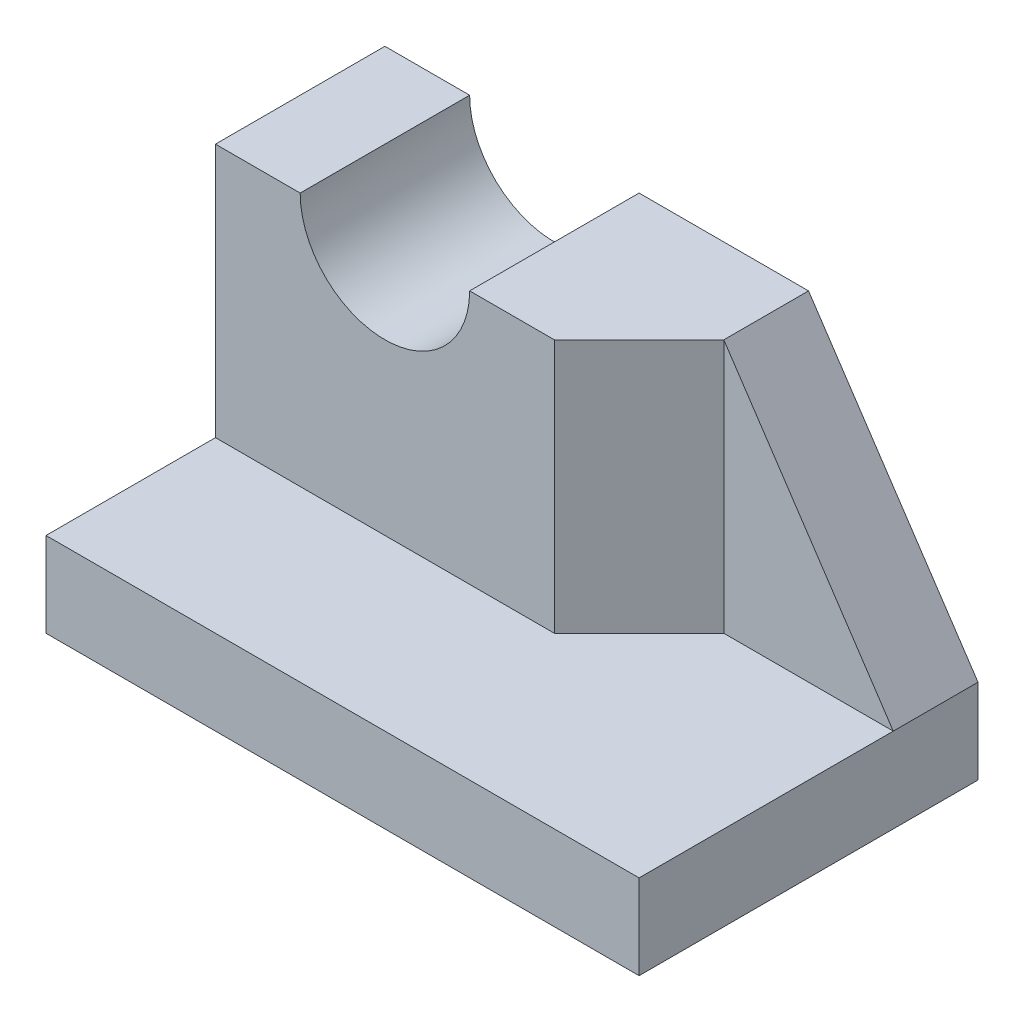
ISO-10303-21;
HEADER;
FILE_DESCRIPTION(('STEP AP214'),'2;1');
FILE_NAME('part.step','',(''),(''),'','','');
FILE_SCHEMA(('AUTOMOTIVE_DESIGN { 1 0 10303 214 1 1 1 1 }'));
ENDSEC;
DATA;
#1=APPLICATION_CONTEXT('core data for automotive mechanical design processes');
#2=APPLICATION_PROTOCOL_DEFINITION('international standard','automotive_design',2000,#1);
#3=PRODUCT_CONTEXT('',#1,'mechanical');
#4=PRODUCT('Part','Part','',(#3));
#5=PRODUCT_RELATED_PRODUCT_CATEGORY('part','',(#4));
#6=PRODUCT_DEFINITION_FORMATION('','',#4);
#7=PRODUCT_DEFINITION_CONTEXT('part definition',#1,'design');
#8=PRODUCT_DEFINITION('design','',#6,#7);
#9=PRODUCT_DEFINITION_SHAPE('','',#8);
#10=(LENGTH_UNIT() NAMED_UNIT(*) SI_UNIT(.MILLI.,.METRE.));
#11=(NAMED_UNIT(*) PLANE_ANGLE_UNIT() SI_UNIT($,.RADIAN.));
#12=(NAMED_UNIT(*) SI_UNIT($,.STERADIAN.) SOLID_ANGLE_UNIT());
#13=UNCERTAINTY_MEASURE_WITH_UNIT(LENGTH_MEASURE(1.E-05),#10,'distance_accuracy_value','');
#14=(GEOMETRIC_REPRESENTATION_CONTEXT(3) GLOBAL_UNCERTAINTY_ASSIGNED_CONTEXT((#13)) GLOBAL_UNIT_ASSIGNED_CONTEXT((#10,
#11,#12)) REPRESENTATION_CONTEXT('',''));
#15=CARTESIAN_POINT('',(0.,0.,0.));
#16=DIRECTION('',(0.,0.,1.));
#17=DIRECTION('',(1.,0.,0.));
#18=AXIS2_PLACEMENT_3D('',#15,#16,#17);
#19=CARTESIAN_POINT('',(-35.,10.,-20.));
#20=DIRECTION('',(0.,-1.,0.));
#21=DIRECTION('',(0.,0.,-1.));
#22=AXIS2_PLACEMENT_3D('',#19,#20,#21);
#23=PLANE('',#22);
#24=DIRECTION('',(1.,0.,0.));
#25=VECTOR('',#24,1.);
#26=CARTESIAN_POINT('',(-35.,10.,-9.99999999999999));
#27=LINE('',#26,#25);
#28=CARTESIAN_POINT('',(15.,10.,-9.99999999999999));
#29=VERTEX_POINT('',#28);
#30=CARTESIAN_POINT('',(35.,10.,-9.99999999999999));
#31=VERTEX_POINT('',#30);
#32=EDGE_CURVE('E125',#29,#31,#27,.T.);
#33=ORIENTED_EDGE('',*,*,#32,.F.);
#34=DIRECTION('',(0.707106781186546,0.,-0.707106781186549));
#35=VECTOR('',#34,1.);
#36=CARTESIAN_POINT('',(4.99999999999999,10.,0.));
#37=LINE('',#36,#35);
#38=CARTESIAN_POINT('',(4.99999999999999,10.,0.));
#39=VERTEX_POINT('',#38);
#40=EDGE_CURVE('E138',#39,#29,#37,.T.);
#41=ORIENTED_EDGE('',*,*,#40,.F.);
#42=DIRECTION('',(1.,0.,0.));
#43=VECTOR('',#42,1.);
#44=CARTESIAN_POINT('',(-35.,10.,0.));
#45=LINE('',#44,#43);
#46=CARTESIAN_POINT('',(-35.,10.,0.));
#47=VERTEX_POINT('',#46);
#48=EDGE_CURVE('E52',#47,#39,#45,.T.);
#49=ORIENTED_EDGE('',*,*,#48,.F.);
#50=DIRECTION('',(0.,0.,1.));
#51=VECTOR('',#50,1.);
#52=CARTESIAN_POINT('',(-35.,10.,20.));
#53=LINE('',#52,#51);
#54=CARTESIAN_POINT('',(-35.,10.,20.));
#55=VERTEX_POINT('',#54);
#56=EDGE_CURVE('E152',#47,#55,#53,.T.);
#57=ORIENTED_EDGE('',*,*,#56,.T.);
#58=DIRECTION('',(1.,0.,0.));
#59=VECTOR('',#58,1.);
#60=CARTESIAN_POINT('',(-35.,10.,20.));
#61=LINE('',#60,#59);
#62=CARTESIAN_POINT('',(35.,10.,20.));
#63=VERTEX_POINT('',#62);
#64=EDGE_CURVE('E149',#55,#63,#61,.T.);
#65=ORIENTED_EDGE('',*,*,#64,.T.);
#66=DIRECTION('',(0.,0.,-1.));
#67=VECTOR('',#66,1.);
#68=CARTESIAN_POINT('',(35.,10.,20.));
#69=LINE('',#68,#67);
#70=EDGE_CURVE('E184',#63,#31,#69,.T.);
#71=ORIENTED_EDGE('',*,*,#70,.T.);
#72=EDGE_LOOP('',(#33,#41,#49,#57,#65,#71));
#73=FACE_BOUND('',#72,.T.);
#74=ADVANCED_FACE('F30',(#73),#23,.F.);
#75=CARTESIAN_POINT('',(-35.,40.,0.));
#76=DIRECTION('',(0.,1.,0.));
#77=DIRECTION('',(0.,0.,1.));
#78=AXIS2_PLACEMENT_3D('',#75,#76,#77);
#79=PLANE('',#78);
#80=DIRECTION('',(0.,0.,1.));
#81=VECTOR('',#80,1.);
#82=CARTESIAN_POINT('',(-35.,40.,-20.));
#83=LINE('',#82,#81);
#84=CARTESIAN_POINT('',(-35.,40.,-20.));
#85=VERTEX_POINT('',#84);
#86=CARTESIAN_POINT('',(-35.,40.,0.));
#87=VERTEX_POINT('',#86);
#88=EDGE_CURVE('E201',#85,#87,#83,.T.);
#89=ORIENTED_EDGE('',*,*,#88,.T.);
#90=DIRECTION('',(1.,0.,0.));
#91=VECTOR('',#90,1.);
#92=CARTESIAN_POINT('',(-35.,40.,0.));
#93=LINE('',#92,#91);
#94=CARTESIAN_POINT('',(-25.,40.,0.));
#95=VERTEX_POINT('',#94);
#96=EDGE_CURVE('E134',#87,#95,#93,.T.);
#97=ORIENTED_EDGE('',*,*,#96,.T.);
#98=DIRECTION('',(0.,0.,1.));
#99=VECTOR('',#98,1.);
#100=CARTESIAN_POINT('',(-25.,40.,-30.));
#101=LINE('',#100,#99);
#102=CARTESIAN_POINT('',(-25.,40.,-20.));
#103=VERTEX_POINT('',#102);
#104=EDGE_CURVE('E11',#103,#95,#101,.T.);
#105=ORIENTED_EDGE('',*,*,#104,.F.);
#106=DIRECTION('',(-1.,0.,0.));
#107=VECTOR('',#106,1.);
#108=CARTESIAN_POINT('',(15.,40.,-20.));
#109=LINE('',#108,#107);
#110=EDGE_CURVE('E117',#103,#85,#109,.T.);
#111=ORIENTED_EDGE('',*,*,#110,.T.);
#112=EDGE_LOOP('',(#89,#97,#105,#111));
#113=FACE_BOUND('',#112,.T.);
#114=ADVANCED_FACE('F207',(#113),#79,.T.);
#115=CARTESIAN_POINT('',(-35.,10.,20.));
#116=DIRECTION('',(1.,0.,0.));
#117=DIRECTION('',(0.,0.,-1.));
#118=AXIS2_PLACEMENT_3D('',#115,#116,#117);
#119=PLANE('',#118);
#120=DIRECTION('',(0.,0.,1.));
#121=VECTOR('',#120,1.);
#122=CARTESIAN_POINT('',(-35.,0.,20.));
#123=LINE('',#122,#121);
#124=CARTESIAN_POINT('',(-35.,0.,-20.));
#125=VERTEX_POINT('',#124);
#126=CARTESIAN_POINT('',(-35.,0.,20.));
#127=VERTEX_POINT('',#126);
#128=EDGE_CURVE('E164',#125,#127,#123,.T.);
#129=ORIENTED_EDGE('',*,*,#128,.T.);
#130=DIRECTION('',(0.,-1.,0.));
#131=VECTOR('',#130,1.);
#132=CARTESIAN_POINT('',(-35.,10.,20.));
#133=LINE('',#132,#131);
#134=EDGE_CURVE('E156',#55,#127,#133,.T.);
#135=ORIENTED_EDGE('',*,*,#134,.F.);
#136=ORIENTED_EDGE('',*,*,#56,.F.);
#137=DIRECTION('',(0.,-1.,0.));
#138=VECTOR('',#137,1.);
#139=CARTESIAN_POINT('',(-35.,40.,0.));
#140=LINE('',#139,#138);
#141=EDGE_CURVE('E142',#87,#47,#140,.T.);
#142=ORIENTED_EDGE('',*,*,#141,.F.);
#143=ORIENTED_EDGE('',*,*,#88,.F.);
#144=DIRECTION('',(0.,-1.,0.));
#145=VECTOR('',#144,1.);
#146=CARTESIAN_POINT('',(-35.,10.,-20.));
#147=LINE('',#146,#145);
#148=EDGE_CURVE('E179',#85,#125,#147,.T.);
#149=ORIENTED_EDGE('',*,*,#148,.T.);
#150=EDGE_LOOP('',(#129,#135,#136,#142,#143,#149));
#151=FACE_BOUND('',#150,.T.);
#152=ADVANCED_FACE('F32',(#151),#119,.F.);
#153=CARTESIAN_POINT('',(-35.,10.,20.));
#154=DIRECTION('',(0.,0.,-1.));
#155=DIRECTION('',(-1.,0.,0.));
#156=AXIS2_PLACEMENT_3D('',#153,#154,#155);
#157=PLANE('',#156);
#158=DIRECTION('',(1.,0.,0.));
#159=VECTOR('',#158,1.);
#160=CARTESIAN_POINT('',(-35.,0.,20.));
#161=LINE('',#160,#159);
#162=CARTESIAN_POINT('',(35.,0.,20.));
#163=VERTEX_POINT('',#162);
#164=EDGE_CURVE('E188',#127,#163,#161,.T.);
#165=ORIENTED_EDGE('',*,*,#164,.T.);
#166=DIRECTION('',(0.,-1.,0.));
#167=VECTOR('',#166,1.);
#168=CARTESIAN_POINT('',(35.,10.,20.));
#169=LINE('',#168,#167);
#170=EDGE_CURVE('E168',#63,#163,#169,.T.);
#171=ORIENTED_EDGE('',*,*,#170,.F.);
#172=ORIENTED_EDGE('',*,*,#64,.F.);
#173=ORIENTED_EDGE('',*,*,#134,.T.);
#174=EDGE_LOOP('',(#165,#171,#172,#173));
#175=FACE_BOUND('',#174,.T.);
#176=ADVANCED_FACE('F191',(#175),#157,.F.);
#177=CARTESIAN_POINT('',(35.,10.,20.));
#178=DIRECTION('',(-1.,0.,0.));
#179=DIRECTION('',(0.,0.,1.));
#180=AXIS2_PLACEMENT_3D('',#177,#178,#179);
#181=PLANE('',#180);
#182=DIRECTION('',(0.,0.,-1.));
#183=VECTOR('',#182,1.);
#184=CARTESIAN_POINT('',(35.,10.,20.));
#185=LINE('',#184,#183);
#186=CARTESIAN_POINT('',(35.,9.99999999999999,-20.));
#187=VERTEX_POINT('',#186);
#188=EDGE_CURVE('E195',#31,#187,#185,.T.);
#189=ORIENTED_EDGE('',*,*,#188,.F.);
#190=ORIENTED_EDGE('',*,*,#70,.F.);
#191=ORIENTED_EDGE('',*,*,#170,.T.);
#192=DIRECTION('',(0.,0.,-1.));
#193=VECTOR('',#192,1.);
#194=CARTESIAN_POINT('',(35.,0.,20.));
#195=LINE('',#194,#193);
#196=CARTESIAN_POINT('',(35.,0.,-20.));
#197=VERTEX_POINT('',#196);
#198=EDGE_CURVE('E186',#163,#197,#195,.T.);
#199=ORIENTED_EDGE('',*,*,#198,.T.);
#200=DIRECTION('',(0.,-1.,0.));
#201=VECTOR('',#200,1.);
#202=CARTESIAN_POINT('',(35.,10.,-20.));
#203=LINE('',#202,#201);
#204=EDGE_CURVE('E173',#187,#197,#203,.T.);
#205=ORIENTED_EDGE('',*,*,#204,.F.);
#206=EDGE_LOOP('',(#189,#190,#191,#199,#205));
#207=FACE_BOUND('',#206,.T.);
#208=ADVANCED_FACE('F193',(#207),#181,.F.);
#209=CARTESIAN_POINT('',(-35.,10.,-20.));
#210=DIRECTION('',(0.,0.,1.));
#211=DIRECTION('',(1.,0.,0.));
#212=AXIS2_PLACEMENT_3D('',#209,#210,#211);
#213=PLANE('',#212);
#214=ORIENTED_EDGE('',*,*,#110,.F.);
#215=CARTESIAN_POINT('',(-15.,40.,-20.));
#216=DIRECTION('',(0.,0.,1.));
#217=DIRECTION('',(1.,0.,0.));
#218=AXIS2_PLACEMENT_3D('',#215,#216,#217);
#219=CIRCLE('',#218,10.);
#220=CARTESIAN_POINT('',(-5.00000000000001,40.,-20.));
#221=VERTEX_POINT('',#220);
#222=EDGE_CURVE('E159',#103,#221,#219,.T.);
#223=ORIENTED_EDGE('',*,*,#222,.T.);
#224=CARTESIAN_POINT('',(15.,40.,-20.));
#225=VERTEX_POINT('',#224);
#226=EDGE_CURVE('E140',#225,#221,#109,.T.);
#227=ORIENTED_EDGE('',*,*,#226,.F.);
#228=DIRECTION('',(0.554700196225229,-0.832050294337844,0.));
#229=VECTOR('',#228,1.);
#230=CARTESIAN_POINT('',(15.,40.,-20.));
#231=LINE('',#230,#229);
#232=EDGE_CURVE('E112',#225,#187,#231,.T.);
#233=ORIENTED_EDGE('',*,*,#232,.T.);
#234=ORIENTED_EDGE('',*,*,#204,.T.);
#235=DIRECTION('',(-1.,0.,0.));
#236=VECTOR('',#235,1.);
#237=CARTESIAN_POINT('',(-35.,0.,-20.));
#238=LINE('',#237,#236);
#239=EDGE_CURVE('E155',#197,#125,#238,.T.);
#240=ORIENTED_EDGE('',*,*,#239,.T.);
#241=ORIENTED_EDGE('',*,*,#148,.F.);
#242=EDGE_LOOP('',(#214,#223,#227,#233,#234,#240,#241));
#243=FACE_BOUND('',#242,.T.);
#244=ADVANCED_FACE('F220',(#243),#213,.F.);
#245=CARTESIAN_POINT('',(-35.,0.,-20.));
#246=DIRECTION('',(0.,-1.,0.));
#247=DIRECTION('',(0.,0.,-1.));
#248=AXIS2_PLACEMENT_3D('',#245,#246,#247);
#249=PLANE('',#248);
#250=ORIENTED_EDGE('',*,*,#239,.F.);
#251=ORIENTED_EDGE('',*,*,#198,.F.);
#252=ORIENTED_EDGE('',*,*,#164,.F.);
#253=ORIENTED_EDGE('',*,*,#128,.F.);
#254=EDGE_LOOP('',(#250,#251,#252,#253));
#255=FACE_BOUND('',#254,.T.);
#256=ADVANCED_FACE('F218',(#255),#249,.T.);
#257=CARTESIAN_POINT('',(-35.,40.,0.));
#258=DIRECTION('',(0.,0.,-1.));
#259=DIRECTION('',(-1.,0.,0.));
#260=AXIS2_PLACEMENT_3D('',#257,#258,#259);
#261=PLANE('',#260);
#262=CARTESIAN_POINT('',(-5.00000000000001,40.,0.));
#263=VERTEX_POINT('',#262);
#264=CARTESIAN_POINT('',(4.99999999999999,40.,0.));
#265=VERTEX_POINT('',#264);
#266=EDGE_CURVE('E130',#263,#265,#93,.T.);
#267=ORIENTED_EDGE('',*,*,#266,.F.);
#268=CARTESIAN_POINT('',(-15.,40.,0.));
#269=DIRECTION('',(0.,0.,1.));
#270=DIRECTION('',(1.,0.,0.));
#271=AXIS2_PLACEMENT_3D('',#268,#269,#270);
#272=CIRCLE('',#271,10.);
#273=EDGE_CURVE('E44',#95,#263,#272,.T.);
#274=ORIENTED_EDGE('',*,*,#273,.F.);
#275=ORIENTED_EDGE('',*,*,#96,.F.);
#276=ORIENTED_EDGE('',*,*,#141,.T.);
#277=ORIENTED_EDGE('',*,*,#48,.T.);
#278=DIRECTION('',(0.,-1.,0.));
#279=VECTOR('',#278,1.);
#280=CARTESIAN_POINT('',(4.99999999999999,40.,0.));
#281=LINE('',#280,#279);
#282=EDGE_CURVE('E139',#265,#39,#281,.T.);
#283=ORIENTED_EDGE('',*,*,#282,.F.);
#284=EDGE_LOOP('',(#267,#274,#275,#276,#277,#283));
#285=FACE_BOUND('',#284,.T.);
#286=ADVANCED_FACE('F212',(#285),#261,.F.);
#287=CARTESIAN_POINT('',(4.99999999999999,40.,0.));
#288=DIRECTION('',(-0.707106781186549,0.,-0.707106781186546));
#289=DIRECTION('',(-0.707106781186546,0.,0.707106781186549));
#290=AXIS2_PLACEMENT_3D('',#287,#288,#289);
#291=PLANE('',#290);
#292=ORIENTED_EDGE('',*,*,#40,.T.);
#293=DIRECTION('',(0.,-1.,0.));
#294=VECTOR('',#293,1.);
#295=CARTESIAN_POINT('',(15.,40.,-10.));
#296=LINE('',#295,#294);
#297=CARTESIAN_POINT('',(15.,40.,-9.99999999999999));
#298=VERTEX_POINT('',#297);
#299=EDGE_CURVE('E123',#298,#29,#296,.T.);
#300=ORIENTED_EDGE('',*,*,#299,.F.);
#301=DIRECTION('',(0.707106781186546,0.,-0.707106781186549));
#302=VECTOR('',#301,1.);
#303=CARTESIAN_POINT('',(4.99999999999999,40.,0.));
#304=LINE('',#303,#302);
#305=EDGE_CURVE('E118',#265,#298,#304,.T.);
#306=ORIENTED_EDGE('',*,*,#305,.F.);
#307=ORIENTED_EDGE('',*,*,#282,.T.);
#308=EDGE_LOOP('',(#292,#300,#306,#307));
#309=FACE_BOUND('',#308,.T.);
#310=ADVANCED_FACE('F137',(#309),#291,.F.);
#311=ORIENTED_EDGE('',*,*,#226,.T.);
#312=DIRECTION('',(0.,0.,1.));
#313=VECTOR('',#312,1.);
#314=CARTESIAN_POINT('',(-5.00000000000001,40.,-30.));
#315=LINE('',#314,#313);
#316=EDGE_CURVE('E38',#263,#221,#315,.F.);
#317=ORIENTED_EDGE('',*,*,#316,.F.);
#318=ORIENTED_EDGE('',*,*,#266,.T.);
#319=ORIENTED_EDGE('',*,*,#305,.T.);
#320=DIRECTION('',(0.,0.,-1.));
#321=VECTOR('',#320,1.);
#322=CARTESIAN_POINT('',(15.,40.,-10.));
#323=LINE('',#322,#321);
#324=EDGE_CURVE('E106',#298,#225,#323,.T.);
#325=ORIENTED_EDGE('',*,*,#324,.T.);
#326=EDGE_LOOP('',(#311,#317,#318,#319,#325));
#327=FACE_BOUND('',#326,.T.);
#328=ADVANCED_FACE('F128',(#327),#79,.T.);
#329=CARTESIAN_POINT('',(-15.,40.,-30.));
#330=DIRECTION('',(0.,0.,1.));
#331=DIRECTION('',(1.,0.,0.));
#332=AXIS2_PLACEMENT_3D('',#329,#330,#331);
#333=CYLINDRICAL_SURFACE('',#332,10.);
#334=ORIENTED_EDGE('',*,*,#104,.T.);
#335=ORIENTED_EDGE('',*,*,#273,.T.);
#336=ORIENTED_EDGE('',*,*,#316,.T.);
#337=ORIENTED_EDGE('',*,*,#222,.F.);
#338=EDGE_LOOP('',(#334,#335,#336,#337));
#339=FACE_BOUND('',#338,.T.);
#340=ADVANCED_FACE('F222',(#339),#333,.F.);
#341=CARTESIAN_POINT('',(15.,40.,-20.));
#342=DIRECTION('',(0.832050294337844,0.554700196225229,0.));
#343=DIRECTION('',(0.554700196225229,-0.832050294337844,0.));
#344=AXIS2_PLACEMENT_3D('',#341,#342,#343);
#345=PLANE('',#344);
#346=DIRECTION('',(0.554700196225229,-0.832050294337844,0.));
#347=VECTOR('',#346,1.);
#348=CARTESIAN_POINT('',(15.,40.,-9.99999999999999));
#349=LINE('',#348,#347);
#350=EDGE_CURVE('E109',#298,#31,#349,.T.);
#351=ORIENTED_EDGE('',*,*,#350,.T.);
#352=ORIENTED_EDGE('',*,*,#188,.T.);
#353=ORIENTED_EDGE('',*,*,#232,.F.);
#354=ORIENTED_EDGE('',*,*,#324,.F.);
#355=EDGE_LOOP('',(#351,#352,#353,#354));
#356=FACE_BOUND('',#355,.T.);
#357=ADVANCED_FACE('F108',(#356),#345,.T.);
#358=CARTESIAN_POINT('',(-1.25000000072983E-05,20.0000125,-9.99999999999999));
#359=DIRECTION('',(0.,0.,-1.));
#360=DIRECTION('',(-1.,0.,0.));
#361=AXIS2_PLACEMENT_3D('',#358,#359,#360);
#362=PLANE('',#361);
#363=ORIENTED_EDGE('',*,*,#299,.T.);
#364=ORIENTED_EDGE('',*,*,#32,.T.);
#365=ORIENTED_EDGE('',*,*,#350,.F.);
#366=EDGE_LOOP('',(#363,#364,#365));
#367=FACE_BOUND('',#366,.T.);
#368=ADVANCED_FACE('F121',(#367),#362,.F.);
#369=CLOSED_SHELL('',(#74,#114,#152,#176,#208,#244,#256,#286,#310,#328,#340,#357,#368));
#370=MANIFOLD_SOLID_BREP('B2',#369);
#371=ADVANCED_BREP_SHAPE_REPRESENTATION('',(#18,#370),#14);
#372=SHAPE_DEFINITION_REPRESENTATION(#9,#371);
ENDSEC;
END-ISO-10303-21;
